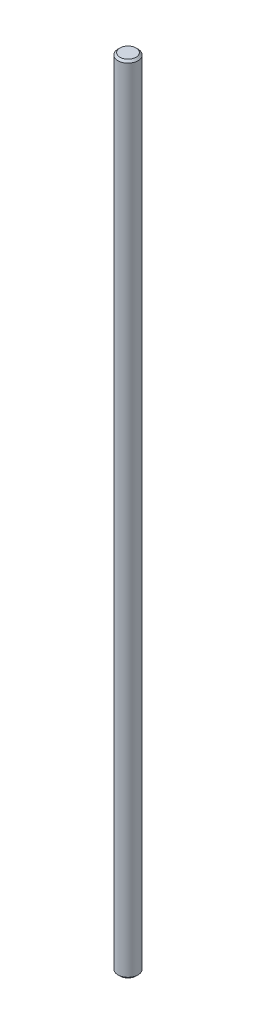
from build123d import *

# Parameters (mm, degrees)
SKETCH1_R      = 2
EXTRUDE1_DEPTH = 158
CHAMFER1_SIZE  = 0.4


with BuildPart() as part:
    # Sketch1 → Extrude1 (new body)
    with BuildSketch(Plane(origin=(0, 0, 0), x_dir=(1, 0, 0), z_dir=(0, 1, 0))):
        with Locations(Location((0, 0, 0), (0, 0, 270))):
            Circle(SKETCH1_R)
    extrude(amount=EXTRUDE1_DEPTH)

    # Chamfer1
    chamfer1_edges = [part.edges().sort_by_distance(p)[0] for p in [
        (0, 0, -2),
        (0, 158, -2),
    ]]
    chamfer(chamfer1_edges, length=CHAMFER1_SIZE)


solid = part.part
